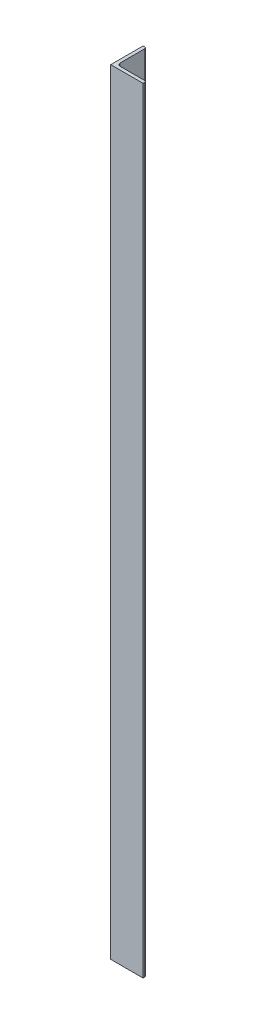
from build123d import *

# Parameters (mm, degrees)
EXTRUSION1_DEPTH = 1200


with BuildPart() as part:
    # Esquisse1 → Extrusion1 (new body)
    with BuildSketch(Plane(origin=(0, 0, 0), x_dir=(1, 0, 0), z_dir=(0, 1, 0))):
        with BuildLine():
            Line((-2.5, 47.5), (-2.5, -2.5))
            Line((-2.5, -2.5), (47.5, -2.5))
            Line((47.5, -2.5), (47.5, 0))
            ThreePointArc((47.5, 0), (46.767766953, 1.767766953), (45, 2.5))
            Line((45, 2.5), (7.5, 2.5))
            ThreePointArc((7.5, 2.5), (3.964466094, 3.964466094), (2.5, 7.5))
            Line((2.5, 7.5), (2.5, 45))
            ThreePointArc((2.5, 45), (1.767766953, 46.767766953), (0, 47.5))
            Line((0, 47.5), (-2.5, 47.5))
        make_face()
    extrude(amount=EXTRUSION1_DEPTH)


solid = part.part
